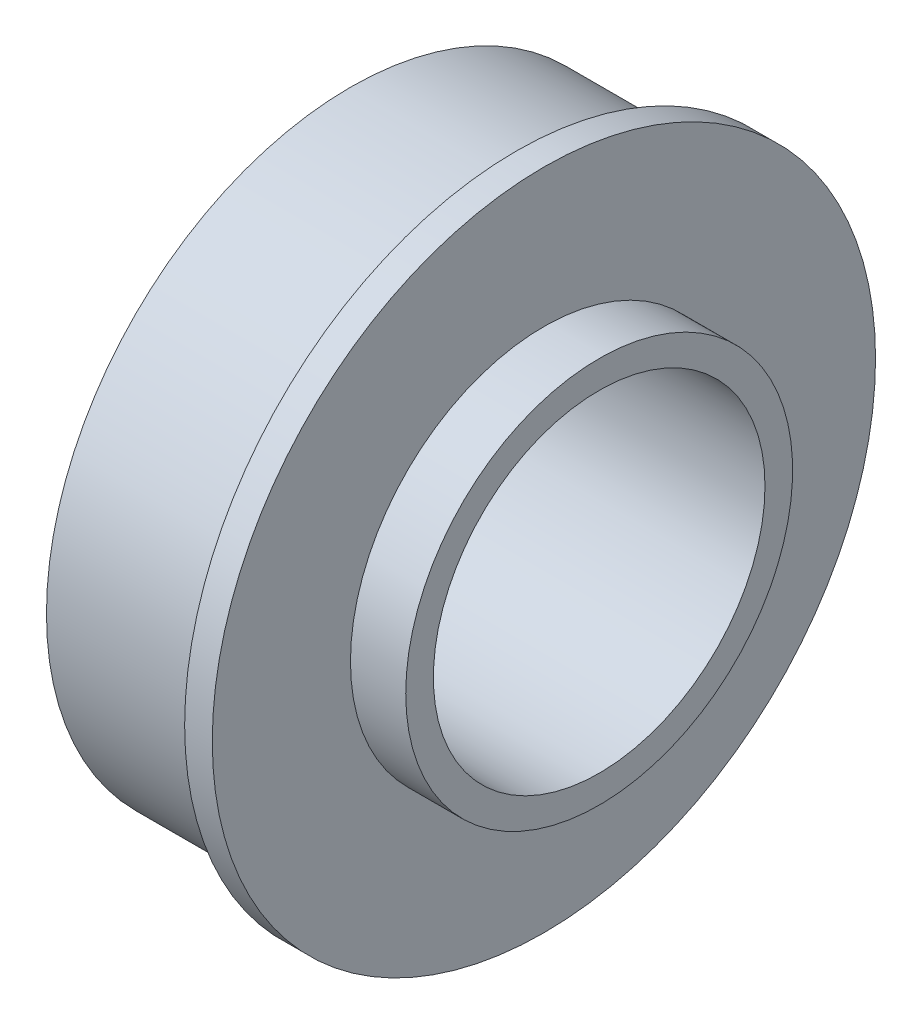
ISO-10303-21;
HEADER;
FILE_DESCRIPTION(('STEP AP214'),'2;1');
FILE_NAME('part.step','',(''),(''),'','','');
FILE_SCHEMA(('AUTOMOTIVE_DESIGN { 1 0 10303 214 1 1 1 1 }'));
ENDSEC;
DATA;
#1=APPLICATION_CONTEXT('core data for automotive mechanical design processes');
#2=APPLICATION_PROTOCOL_DEFINITION('international standard','automotive_design',2000,#1);
#3=PRODUCT_CONTEXT('',#1,'mechanical');
#4=PRODUCT('Part','Part','',(#3));
#5=PRODUCT_RELATED_PRODUCT_CATEGORY('part','',(#4));
#6=PRODUCT_DEFINITION_FORMATION('','',#4);
#7=PRODUCT_DEFINITION_CONTEXT('part definition',#1,'design');
#8=PRODUCT_DEFINITION('design','',#6,#7);
#9=PRODUCT_DEFINITION_SHAPE('','',#8);
#10=(LENGTH_UNIT() NAMED_UNIT(*) SI_UNIT(.MILLI.,.METRE.));
#11=(NAMED_UNIT(*) PLANE_ANGLE_UNIT() SI_UNIT($,.RADIAN.));
#12=(NAMED_UNIT(*) SI_UNIT($,.STERADIAN.) SOLID_ANGLE_UNIT());
#13=UNCERTAINTY_MEASURE_WITH_UNIT(LENGTH_MEASURE(1.E-05),#10,'distance_accuracy_value','');
#14=(GEOMETRIC_REPRESENTATION_CONTEXT(3) GLOBAL_UNCERTAINTY_ASSIGNED_CONTEXT((#13)) GLOBAL_UNIT_ASSIGNED_CONTEXT((#10,
#11,#12)) REPRESENTATION_CONTEXT('',''));
#15=CARTESIAN_POINT('',(0.,0.,0.));
#16=DIRECTION('',(0.,0.,1.));
#17=DIRECTION('',(1.,0.,0.));
#18=AXIS2_PLACEMENT_3D('',#15,#16,#17);
#19=CARTESIAN_POINT('',(1.5875,0.,0.));
#20=DIRECTION('',(1.,0.,0.));
#21=DIRECTION('',(0.,0.,-1.));
#22=AXIS2_PLACEMENT_3D('',#19,#20,#21);
#23=PLANE('',#22);
#24=CARTESIAN_POINT('',(1.5875,0.,0.));
#25=DIRECTION('',(1.,0.,0.));
#26=DIRECTION('',(0.,0.,-1.));
#27=AXIS2_PLACEMENT_3D('',#24,#25,#26);
#28=CIRCLE('',#27,19.05);
#29=CARTESIAN_POINT('',(1.5875,0.,-19.05));
#30=VERTEX_POINT('',#29);
#31=EDGE_CURVE('E75',#30,#30,#28,.T.);
#32=ORIENTED_EDGE('',*,*,#31,.T.);
#33=EDGE_LOOP('',(#32));
#34=FACE_BOUND('',#33,.T.);
#35=CARTESIAN_POINT('',(1.5875,0.,0.));
#36=DIRECTION('',(1.,0.,0.));
#37=DIRECTION('',(0.,0.,-1.));
#38=AXIS2_PLACEMENT_3D('',#35,#36,#37);
#39=CIRCLE('',#38,11.1125);
#40=CARTESIAN_POINT('',(1.5875,0.,11.1125));
#41=VERTEX_POINT('',#40);
#42=EDGE_CURVE('E59',#41,#41,#39,.F.);
#43=ORIENTED_EDGE('',*,*,#42,.T.);
#44=EDGE_LOOP('',(#43));
#45=FACE_BOUND('',#44,.T.);
#46=ADVANCED_FACE('F55',(#34,#45),#23,.T.);
#47=CARTESIAN_POINT('',(1.5875,0.,0.));
#48=DIRECTION('',(-1.,0.,0.));
#49=DIRECTION('',(0.,0.,1.));
#50=AXIS2_PLACEMENT_3D('',#47,#48,#49);
#51=CYLINDRICAL_SURFACE('',#50,17.4625);
#52=CARTESIAN_POINT('',(-9.525,0.,0.));
#53=DIRECTION('',(1.,0.,0.));
#54=DIRECTION('',(0.,0.,-1.));
#55=AXIS2_PLACEMENT_3D('',#52,#53,#54);
#56=CIRCLE('',#55,17.4625);
#57=CARTESIAN_POINT('',(-9.525,0.,-17.4625));
#58=VERTEX_POINT('',#57);
#59=EDGE_CURVE('E64',#58,#58,#56,.T.);
#60=ORIENTED_EDGE('',*,*,#59,.T.);
#61=EDGE_LOOP('',(#60));
#62=FACE_BOUND('',#61,.T.);
#63=CARTESIAN_POINT('',(0.,0.,0.));
#64=DIRECTION('',(1.,0.,0.));
#65=DIRECTION('',(0.,0.,-1.));
#66=AXIS2_PLACEMENT_3D('',#63,#64,#65);
#67=CIRCLE('',#66,17.4625);
#68=CARTESIAN_POINT('',(0.,0.,-17.4625));
#69=VERTEX_POINT('',#68);
#70=EDGE_CURVE('E11',#69,#69,#67,.T.);
#71=ORIENTED_EDGE('',*,*,#70,.F.);
#72=EDGE_LOOP('',(#71));
#73=FACE_BOUND('',#72,.T.);
#74=ADVANCED_FACE('F57',(#62,#73),#51,.T.);
#75=CARTESIAN_POINT('',(1.5875,0.,0.));
#76=DIRECTION('',(-1.,0.,0.));
#77=DIRECTION('',(0.,0.,1.));
#78=AXIS2_PLACEMENT_3D('',#75,#76,#77);
#79=CYLINDRICAL_SURFACE('',#78,9.525);
#80=CARTESIAN_POINT('',(-9.525,0.,0.));
#81=DIRECTION('',(1.,0.,0.));
#82=DIRECTION('',(0.,0.,-1.));
#83=AXIS2_PLACEMENT_3D('',#80,#81,#82);
#84=CIRCLE('',#83,9.525);
#85=CARTESIAN_POINT('',(-9.525,0.,-9.525));
#86=VERTEX_POINT('',#85);
#87=EDGE_CURVE('E69',#86,#86,#84,.T.);
#88=ORIENTED_EDGE('',*,*,#87,.F.);
#89=EDGE_LOOP('',(#88));
#90=FACE_BOUND('',#89,.T.);
#91=CARTESIAN_POINT('',(4.7625,0.,0.));
#92=DIRECTION('',(1.,0.,0.));
#93=DIRECTION('',(0.,0.,-1.));
#94=AXIS2_PLACEMENT_3D('',#91,#92,#93);
#95=CIRCLE('',#94,9.525);
#96=CARTESIAN_POINT('',(4.7625,0.,-9.525));
#97=VERTEX_POINT('',#96);
#98=EDGE_CURVE('E87',#97,#97,#95,.T.);
#99=ORIENTED_EDGE('',*,*,#98,.T.);
#100=EDGE_LOOP('',(#99));
#101=FACE_BOUND('',#100,.T.);
#102=ADVANCED_FACE('F92',(#90,#101),#79,.F.);
#103=CARTESIAN_POINT('',(-9.525,0.,0.));
#104=DIRECTION('',(1.,0.,0.));
#105=DIRECTION('',(0.,0.,-1.));
#106=AXIS2_PLACEMENT_3D('',#103,#104,#105);
#107=PLANE('',#106);
#108=ORIENTED_EDGE('',*,*,#87,.T.);
#109=EDGE_LOOP('',(#108));
#110=FACE_BOUND('',#109,.T.);
#111=ORIENTED_EDGE('',*,*,#59,.F.);
#112=EDGE_LOOP('',(#111));
#113=FACE_BOUND('',#112,.T.);
#114=ADVANCED_FACE('F119',(#110,#113),#107,.F.);
#115=CARTESIAN_POINT('',(0.,0.,0.));
#116=DIRECTION('',(1.,0.,0.));
#117=DIRECTION('',(0.,0.,-1.));
#118=AXIS2_PLACEMENT_3D('',#115,#116,#117);
#119=PLANE('',#118);
#120=CARTESIAN_POINT('',(0.,0.,0.));
#121=DIRECTION('',(1.,0.,0.));
#122=DIRECTION('',(0.,0.,-1.));
#123=AXIS2_PLACEMENT_3D('',#120,#121,#122);
#124=CIRCLE('',#123,19.05);
#125=CARTESIAN_POINT('',(0.,0.,-19.05));
#126=VERTEX_POINT('',#125);
#127=EDGE_CURVE('E76',#126,#126,#124,.T.);
#128=ORIENTED_EDGE('',*,*,#127,.F.);
#129=EDGE_LOOP('',(#128));
#130=FACE_BOUND('',#129,.T.);
#131=ORIENTED_EDGE('',*,*,#70,.T.);
#132=EDGE_LOOP('',(#131));
#133=FACE_BOUND('',#132,.T.);
#134=ADVANCED_FACE('F107',(#130,#133),#119,.F.);
#135=CARTESIAN_POINT('',(1.5875,0.,0.));
#136=DIRECTION('',(-1.,0.,0.));
#137=DIRECTION('',(0.,0.,1.));
#138=AXIS2_PLACEMENT_3D('',#135,#136,#137);
#139=CYLINDRICAL_SURFACE('',#138,19.05);
#140=ORIENTED_EDGE('',*,*,#31,.F.);
#141=EDGE_LOOP('',(#140));
#142=FACE_BOUND('',#141,.T.);
#143=ORIENTED_EDGE('',*,*,#127,.T.);
#144=EDGE_LOOP('',(#143));
#145=FACE_BOUND('',#144,.T.);
#146=ADVANCED_FACE('F97',(#142,#145),#139,.T.);
#147=CARTESIAN_POINT('',(4.7625,0.,0.));
#148=DIRECTION('',(1.,0.,0.));
#149=DIRECTION('',(0.,0.,-1.));
#150=AXIS2_PLACEMENT_3D('',#147,#148,#149);
#151=PLANE('',#150);
#152=CARTESIAN_POINT('',(4.7625,0.,0.));
#153=DIRECTION('',(1.,0.,0.));
#154=DIRECTION('',(0.,0.,-1.));
#155=AXIS2_PLACEMENT_3D('',#152,#153,#154);
#156=CIRCLE('',#155,11.1125);
#157=CARTESIAN_POINT('',(4.7625,0.,11.1125));
#158=VERTEX_POINT('',#157);
#159=EDGE_CURVE('E83',#158,#158,#156,.T.);
#160=ORIENTED_EDGE('',*,*,#159,.T.);
#161=EDGE_LOOP('',(#160));
#162=FACE_BOUND('',#161,.T.);
#163=ORIENTED_EDGE('',*,*,#98,.F.);
#164=EDGE_LOOP('',(#163));
#165=FACE_BOUND('',#164,.T.);
#166=ADVANCED_FACE('F94',(#162,#165),#151,.T.);
#167=CARTESIAN_POINT('',(4.7625,0.,0.));
#168=DIRECTION('',(-1.,0.,0.));
#169=DIRECTION('',(0.,0.,1.));
#170=AXIS2_PLACEMENT_3D('',#167,#168,#169);
#171=CYLINDRICAL_SURFACE('',#170,11.1125);
#172=CARTESIAN_POINT('',(1.5875,0.,11.1125));
#173=CARTESIAN_POINT('',(1.62057291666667,0.,11.1125));
#174=CARTESIAN_POINT('',(1.65364583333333,0.,11.1125));
#175=CARTESIAN_POINT('',(1.71979166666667,0.,11.1125));
#176=CARTESIAN_POINT('',(1.75286458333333,0.,11.1125));
#177=CARTESIAN_POINT('',(1.81901041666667,0.,11.1125));
#178=CARTESIAN_POINT('',(1.85208333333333,0.,11.1125));
#179=CARTESIAN_POINT('',(1.91822916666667,0.,11.1125));
#180=CARTESIAN_POINT('',(1.95130208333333,0.,11.1125));
#181=CARTESIAN_POINT('',(2.01744791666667,0.,11.1125));
#182=CARTESIAN_POINT('',(2.05052083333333,0.,11.1125));
#183=CARTESIAN_POINT('',(2.11666666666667,0.,11.1125));
#184=CARTESIAN_POINT('',(2.14973958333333,0.,11.1125));
#185=CARTESIAN_POINT('',(2.21588541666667,0.,11.1125));
#186=CARTESIAN_POINT('',(2.24895833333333,0.,11.1125));
#187=CARTESIAN_POINT('',(2.31510416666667,0.,11.1125));
#188=CARTESIAN_POINT('',(2.34817708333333,0.,11.1125));
#189=CARTESIAN_POINT('',(2.41432291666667,0.,11.1125));
#190=CARTESIAN_POINT('',(2.44739583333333,0.,11.1125));
#191=CARTESIAN_POINT('',(2.51354166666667,0.,11.1125));
#192=CARTESIAN_POINT('',(2.54661458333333,0.,11.1125));
#193=CARTESIAN_POINT('',(2.61276041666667,0.,11.1125));
#194=CARTESIAN_POINT('',(2.64583333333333,0.,11.1125));
#195=CARTESIAN_POINT('',(2.71197916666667,0.,11.1125));
#196=CARTESIAN_POINT('',(2.74505208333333,0.,11.1125));
#197=CARTESIAN_POINT('',(2.81119791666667,0.,11.1125));
#198=CARTESIAN_POINT('',(2.84427083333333,0.,11.1125));
#199=CARTESIAN_POINT('',(2.91041666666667,0.,11.1125));
#200=CARTESIAN_POINT('',(2.94348958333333,0.,11.1125));
#201=CARTESIAN_POINT('',(3.00963541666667,0.,11.1125));
#202=CARTESIAN_POINT('',(3.04270833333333,0.,11.1125));
#203=CARTESIAN_POINT('',(3.10885416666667,0.,11.1125));
#204=CARTESIAN_POINT('',(3.14192708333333,0.,11.1125));
#205=CARTESIAN_POINT('',(3.20807291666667,0.,11.1125));
#206=CARTESIAN_POINT('',(3.24114583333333,0.,11.1125));
#207=CARTESIAN_POINT('',(3.30729166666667,0.,11.1125));
#208=CARTESIAN_POINT('',(3.34036458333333,0.,11.1125));
#209=CARTESIAN_POINT('',(3.40651041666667,0.,11.1125));
#210=CARTESIAN_POINT('',(3.43958333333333,0.,11.1125));
#211=CARTESIAN_POINT('',(3.50572916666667,0.,11.1125));
#212=CARTESIAN_POINT('',(3.53880208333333,0.,11.1125));
#213=CARTESIAN_POINT('',(3.60494791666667,0.,11.1125));
#214=CARTESIAN_POINT('',(3.63802083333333,0.,11.1125));
#215=CARTESIAN_POINT('',(3.70416666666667,0.,11.1125));
#216=CARTESIAN_POINT('',(3.73723958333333,0.,11.1125));
#217=CARTESIAN_POINT('',(3.80338541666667,0.,11.1125));
#218=CARTESIAN_POINT('',(3.83645833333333,0.,11.1125));
#219=CARTESIAN_POINT('',(3.90260416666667,0.,11.1125));
#220=CARTESIAN_POINT('',(3.93567708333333,0.,11.1125));
#221=CARTESIAN_POINT('',(4.00182291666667,0.,11.1125));
#222=CARTESIAN_POINT('',(4.03489583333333,0.,11.1125));
#223=CARTESIAN_POINT('',(4.10104166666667,0.,11.1125));
#224=CARTESIAN_POINT('',(4.13411458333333,0.,11.1125));
#225=CARTESIAN_POINT('',(4.20026041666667,0.,11.1125));
#226=CARTESIAN_POINT('',(4.23333333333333,0.,11.1125));
#227=CARTESIAN_POINT('',(4.29947916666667,0.,11.1125));
#228=CARTESIAN_POINT('',(4.33255208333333,0.,11.1125));
#229=CARTESIAN_POINT('',(4.39869791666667,0.,11.1125));
#230=CARTESIAN_POINT('',(4.43177083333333,0.,11.1125));
#231=CARTESIAN_POINT('',(4.49791666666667,0.,11.1125));
#232=CARTESIAN_POINT('',(4.53098958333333,0.,11.1125));
#233=CARTESIAN_POINT('',(4.59713541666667,0.,11.1125));
#234=CARTESIAN_POINT('',(4.63020833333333,0.,11.1125));
#235=CARTESIAN_POINT('',(4.69635416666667,0.,11.1125));
#236=CARTESIAN_POINT('',(4.72942708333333,0.,11.1125));
#237=CARTESIAN_POINT('',(4.7625,0.,11.1125));
#238=B_SPLINE_CURVE_WITH_KNOTS('',3,(#172,#173,#174,#175,#176,#177,#178,#179,#180,#181,#182,
#183,#184,#185,#186,#187,#188,#189,#190,#191,#192,#193,#194,#195,#196,#197,#198,#199,#200,#201,
#202,#203,#204,#205,#206,#207,#208,#209,#210,#211,#212,#213,#214,#215,#216,#217,#218,#219,#220,
#221,#222,#223,#224,#225,#226,#227,#228,#229,#230,#231,#232,#233,#234,#235,#236,#237),
.UNSPECIFIED.,.F.,.F.,(4,2,2,2,2,2,2,2,2,2,2,2,2,2,2,2,2,2,2,2,2,2,2,2,2,2,2,2,2,2,2,2,4),(0.,
0.0992187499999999,0.1984375,0.29765625,0.396875,0.49609375,0.5953125,0.69453125,0.79375,
0.89296875,0.9921875,1.09140625,1.190625,1.28984375,1.3890625,1.48828125,1.5875,1.68671875,
1.7859375,1.88515625,1.984375,2.08359375,2.1828125,2.28203125,2.38125,2.48046875,2.5796875,
2.67890625,2.778125,2.87734375,2.9765625,3.07578125,3.175),.UNSPECIFIED.);
#239=EDGE_CURVE('BSEAM96',#41,#158,#238,.T.);
#240=ORIENTED_EDGE('',*,*,#42,.F.);
#241=ORIENTED_EDGE('',*,*,#159,.F.);
#242=ORIENTED_EDGE('',*,*,#239,.T.);
#243=ORIENTED_EDGE('',*,*,#239,.F.);
#244=EDGE_LOOP('',(#240,#242,#241,#243));
#245=FACE_BOUND('',#244,.T.);
#246=ADVANCED_FACE('F96',(#245),#171,.T.);
#247=CLOSED_SHELL('',(#46,#74,#102,#114,#134,#146,#166,#246));
#248=MANIFOLD_SOLID_BREP('B2',#247);
#249=ADVANCED_BREP_SHAPE_REPRESENTATION('',(#18,#248),#14);
#250=SHAPE_DEFINITION_REPRESENTATION(#9,#249);
ENDSEC;
END-ISO-10303-21;
